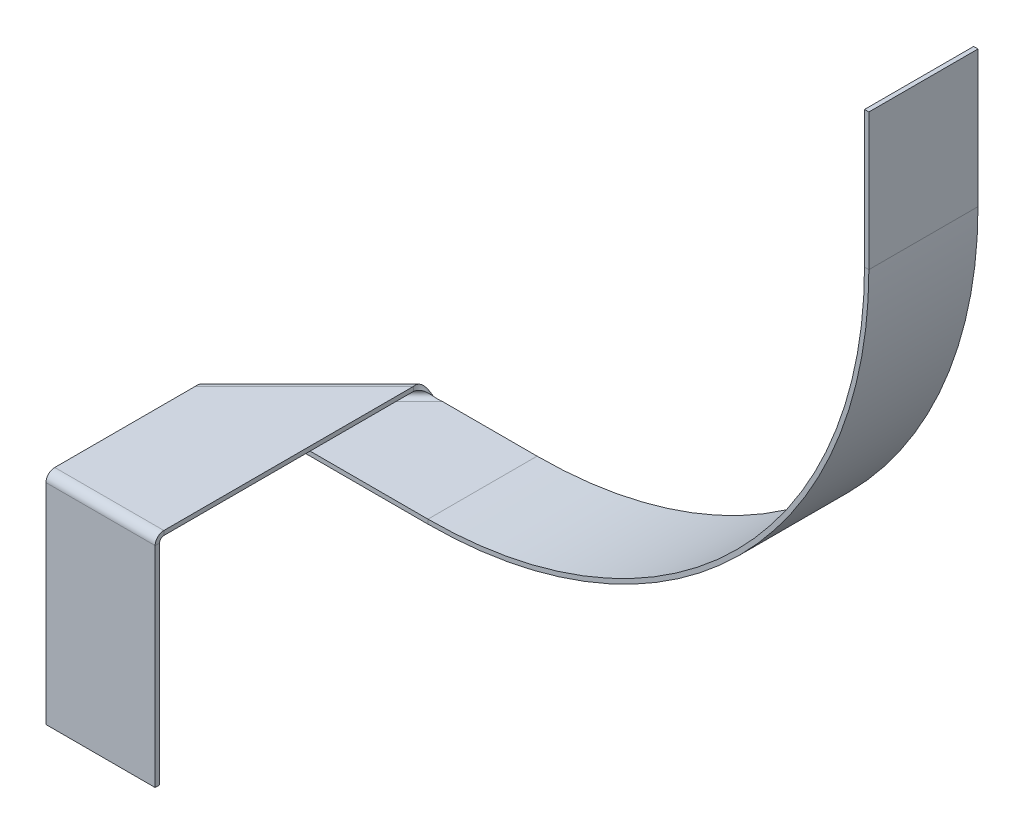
ISO-10303-21;
HEADER;
FILE_DESCRIPTION(('STEP AP214'),'2;1');
FILE_NAME('part.step','',(''),(''),'','','');
FILE_SCHEMA(('AUTOMOTIVE_DESIGN { 1 0 10303 214 1 1 1 1 }'));
ENDSEC;
DATA;
#1=APPLICATION_CONTEXT('core data for automotive mechanical design processes');
#2=APPLICATION_PROTOCOL_DEFINITION('international standard','automotive_design',2000,#1);
#3=PRODUCT_CONTEXT('',#1,'mechanical');
#4=PRODUCT('Part','Part','',(#3));
#5=PRODUCT_RELATED_PRODUCT_CATEGORY('part','',(#4));
#6=PRODUCT_DEFINITION_FORMATION('','',#4);
#7=PRODUCT_DEFINITION_CONTEXT('part definition',#1,'design');
#8=PRODUCT_DEFINITION('design','',#6,#7);
#9=PRODUCT_DEFINITION_SHAPE('','',#8);
#10=(LENGTH_UNIT() NAMED_UNIT(*) SI_UNIT(.MILLI.,.METRE.));
#11=(NAMED_UNIT(*) PLANE_ANGLE_UNIT() SI_UNIT($,.RADIAN.));
#12=(NAMED_UNIT(*) SI_UNIT($,.STERADIAN.) SOLID_ANGLE_UNIT());
#13=UNCERTAINTY_MEASURE_WITH_UNIT(LENGTH_MEASURE(1.E-05),#10,'distance_accuracy_value','');
#14=(GEOMETRIC_REPRESENTATION_CONTEXT(3) GLOBAL_UNCERTAINTY_ASSIGNED_CONTEXT((#13)) GLOBAL_UNIT_ASSIGNED_CONTEXT((#10,
#11,#12)) REPRESENTATION_CONTEXT('',''));
#15=CARTESIAN_POINT('',(0.,0.,0.));
#16=DIRECTION('',(0.,0.,1.));
#17=DIRECTION('',(1.,0.,0.));
#18=AXIS2_PLACEMENT_3D('',#15,#16,#17);
#19=CARTESIAN_POINT('',(453.287611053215,94.0000000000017,-124.999999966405));
#20=DIRECTION('',(0.,-1.,0.));
#21=DIRECTION('',(0.,0.,-1.));
#22=AXIS2_PLACEMENT_3D('',#19,#20,#21);
#23=PLANE('',#22);
#24=DIRECTION('',(-1.,0.,0.));
#25=VECTOR('',#24,1.);
#26=CARTESIAN_POINT('',(453.287611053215,94.0000000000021,-74.9999999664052));
#27=LINE('',#26,#25);
#28=CARTESIAN_POINT('',(75.,94.0000000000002,-74.9999999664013));
#29=VERTEX_POINT('',#28);
#30=CARTESIAN_POINT('',(-18.3356755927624,93.9999999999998,-74.9999999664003));
#31=VERTEX_POINT('',#30);
#32=EDGE_CURVE('E78',#29,#31,#27,.T.);
#33=ORIENTED_EDGE('',*,*,#32,.F.);
#34=DIRECTION('',(0.,0.,-1.));
#35=VECTOR('',#34,1.);
#36=CARTESIAN_POINT('',(75.,93.9999999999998,-124.999999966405));
#37=LINE('',#36,#35);
#38=CARTESIAN_POINT('',(75.,93.9999999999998,-124.999999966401));
#39=VERTEX_POINT('',#38);
#40=EDGE_CURVE('E70',#29,#39,#37,.T.);
#41=ORIENTED_EDGE('',*,*,#40,.T.);
#42=DIRECTION('',(-1.,0.,0.));
#43=VECTOR('',#42,1.);
#44=CARTESIAN_POINT('',(453.287611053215,94.0000000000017,-124.999999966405));
#45=LINE('',#44,#43);
#46=CARTESIAN_POINT('',(31.6643244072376,93.9999999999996,-124.999999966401));
#47=VERTEX_POINT('',#46);
#48=EDGE_CURVE('E86',#39,#47,#45,.T.);
#49=ORIENTED_EDGE('',*,*,#48,.T.);
#50=DIRECTION('',(0.707106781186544,0.,-0.707106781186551));
#51=VECTOR('',#50,1.);
#52=CARTESIAN_POINT('',(242.475967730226,93.9999999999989,-335.811643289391));
#53=LINE('',#52,#51);
#54=EDGE_CURVE('E222',#31,#47,#53,.T.);
#55=ORIENTED_EDGE('',*,*,#54,.F.);
#56=EDGE_LOOP('',(#33,#41,#49,#55));
#57=FACE_BOUND('',#56,.T.);
#58=ADVANCED_FACE('F60',(#57),#23,.F.);
#59=CARTESIAN_POINT('',(25.,97.9999999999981,-553.287611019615));
#60=DIRECTION('',(0.,1.,0.));
#61=DIRECTION('',(1.,0.,0.));
#62=AXIS2_PLACEMENT_3D('',#59,#60,#61);
#63=PLANE('',#62);
#64=DIRECTION('',(0.,0.,1.));
#65=VECTOR('',#64,1.);
#66=CARTESIAN_POINT('',(-25.,97.9999999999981,-553.287611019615));
#67=LINE('',#66,#65);
#68=CARTESIAN_POINT('',(-25.,97.9999999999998,-68.3356755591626));
#69=VERTEX_POINT('',#68);
#70=CARTESIAN_POINT('',(-25.,98.,-3.99999999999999));
#71=VERTEX_POINT('',#70);
#72=EDGE_CURVE('E391',#69,#71,#67,.T.);
#73=ORIENTED_EDGE('',*,*,#72,.F.);
#74=DIRECTION('',(0.707106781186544,0.,-0.707106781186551));
#75=VECTOR('',#74,1.);
#76=CARTESIAN_POINT('',(242.475967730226,97.9999999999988,-335.811643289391));
#77=LINE('',#76,#75);
#78=CARTESIAN_POINT('',(25.,97.9999999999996,-118.335675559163));
#79=VERTEX_POINT('',#78);
#80=EDGE_CURVE('E418',#69,#79,#77,.T.);
#81=ORIENTED_EDGE('',*,*,#80,.T.);
#82=DIRECTION('',(0.,0.,1.));
#83=VECTOR('',#82,1.);
#84=CARTESIAN_POINT('',(25.,97.9999999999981,-553.287611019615));
#85=LINE('',#84,#83);
#86=CARTESIAN_POINT('',(25.,98.,-3.99999999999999));
#87=VERTEX_POINT('',#86);
#88=EDGE_CURVE('E358',#79,#87,#85,.T.);
#89=ORIENTED_EDGE('',*,*,#88,.T.);
#90=DIRECTION('',(-1.,0.,0.));
#91=VECTOR('',#90,1.);
#92=CARTESIAN_POINT('',(25.,98.,-3.99999999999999));
#93=LINE('',#92,#91);
#94=EDGE_CURVE('E394',#87,#71,#93,.T.);
#95=ORIENTED_EDGE('',*,*,#94,.T.);
#96=EDGE_LOOP('',(#73,#81,#89,#95));
#97=FACE_BOUND('',#96,.T.);
#98=ADVANCED_FACE('F431',(#97),#63,.F.);
#99=CARTESIAN_POINT('',(-25.,99.9999999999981,-553.287611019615));
#100=DIRECTION('',(-1.,0.,0.));
#101=DIRECTION('',(0.,1.,0.));
#102=AXIS2_PLACEMENT_3D('',#99,#100,#101);
#103=PLANE('',#102);
#104=CARTESIAN_POINT('',(-25.,98.0000000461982,-68.3356755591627));
#105=CARTESIAN_POINT('',(-25.,100.000000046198,-68.3356755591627));
#106=B_SPLINE_CURVE_WITH_KNOTS('',1,(#104,#105),.UNSPECIFIED.,.F.,.F.,(2,2),(0.,1.),.UNSPECIFIED.);
#107=CARTESIAN_POINT('',(-25.,100.000000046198,-68.3356755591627));
#108=VERTEX_POINT('',#107);
#109=EDGE_CURVE('E413',#69,#108,#106,.T.);
#110=ORIENTED_EDGE('',*,*,#109,.F.);
#111=ORIENTED_EDGE('',*,*,#72,.T.);
#112=DIRECTION('',(0.,-1.,0.));
#113=VECTOR('',#112,1.);
#114=CARTESIAN_POINT('',(-25.,100.,-4.));
#115=LINE('',#114,#113);
#116=CARTESIAN_POINT('',(-25.,100.000000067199,-4.00000000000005));
#117=VERTEX_POINT('',#116);
#118=EDGE_CURVE('E390',#117,#71,#115,.T.);
#119=ORIENTED_EDGE('',*,*,#118,.F.);
#120=DIRECTION('',(0.,0.,1.));
#121=VECTOR('',#120,1.);
#122=CARTESIAN_POINT('',(-25.,99.9999999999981,-553.287611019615));
#123=LINE('',#122,#121);
#124=EDGE_CURVE('E401',#108,#117,#123,.T.);
#125=ORIENTED_EDGE('',*,*,#124,.F.);
#126=EDGE_LOOP('',(#110,#111,#119,#125));
#127=FACE_BOUND('',#126,.T.);
#128=ADVANCED_FACE('F420',(#127),#103,.T.);
#129=CARTESIAN_POINT('',(25.,99.9999999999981,-553.287611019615));
#130=DIRECTION('',(0.,1.,0.));
#131=DIRECTION('',(1.,0.,0.));
#132=AXIS2_PLACEMENT_3D('',#129,#130,#131);
#133=PLANE('',#132);
#134=DIRECTION('',(0.707106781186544,0.,-0.707106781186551));
#135=VECTOR('',#134,1.);
#136=CARTESIAN_POINT('',(242.475967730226,99.9999999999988,-335.811643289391));
#137=LINE('',#136,#135);
#138=CARTESIAN_POINT('',(25.,99.9999999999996,-118.335675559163));
#139=VERTEX_POINT('',#138);
#140=EDGE_CURVE('E400',#108,#139,#137,.T.);
#141=ORIENTED_EDGE('',*,*,#140,.F.);
#142=ORIENTED_EDGE('',*,*,#124,.T.);
#143=DIRECTION('',(-1.,0.,0.));
#144=VECTOR('',#143,1.);
#145=CARTESIAN_POINT('',(25.,100.,-4.));
#146=LINE('',#145,#144);
#147=CARTESIAN_POINT('',(25.,100.,-4.));
#148=VERTEX_POINT('',#147);
#149=EDGE_CURVE('E387',#148,#117,#146,.T.);
#150=ORIENTED_EDGE('',*,*,#149,.F.);
#151=DIRECTION('',(0.,0.,1.));
#152=VECTOR('',#151,1.);
#153=CARTESIAN_POINT('',(25.,99.9999999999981,-553.287611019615));
#154=LINE('',#153,#152);
#155=EDGE_CURVE('E403',#139,#148,#154,.T.);
#156=ORIENTED_EDGE('',*,*,#155,.F.);
#157=EDGE_LOOP('',(#141,#142,#150,#156));
#158=FACE_BOUND('',#157,.T.);
#159=ADVANCED_FACE('F430',(#158),#133,.T.);
#160=CARTESIAN_POINT('',(25.,97.9999999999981,-553.287611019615));
#161=DIRECTION('',(1.,0.,0.));
#162=DIRECTION('',(0.,-1.,0.));
#163=AXIS2_PLACEMENT_3D('',#160,#161,#162);
#164=PLANE('',#163);
#165=CARTESIAN_POINT('',(25.,100.000000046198,-118.335675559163));
#166=CARTESIAN_POINT('',(25.,98.000000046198,-118.335675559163));
#167=B_SPLINE_CURVE_WITH_KNOTS('',1,(#165,#166),.UNSPECIFIED.,.F.,.F.,(2,2),(0.,1.),.UNSPECIFIED.);
#168=EDGE_CURVE('E334',#139,#79,#167,.T.);
#169=ORIENTED_EDGE('',*,*,#168,.F.);
#170=ORIENTED_EDGE('',*,*,#155,.T.);
#171=DIRECTION('',(0.,1.,0.));
#172=VECTOR('',#171,1.);
#173=CARTESIAN_POINT('',(25.,98.,-3.99999999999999));
#174=LINE('',#173,#172);
#175=EDGE_CURVE('E397',#87,#148,#174,.T.);
#176=ORIENTED_EDGE('',*,*,#175,.F.);
#177=ORIENTED_EDGE('',*,*,#88,.F.);
#178=EDGE_LOOP('',(#169,#170,#176,#177));
#179=FACE_BOUND('',#178,.T.);
#180=ADVANCED_FACE('F560',(#179),#164,.T.);
#181=CARTESIAN_POINT('',(-25.,0.,-1.99999999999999));
#182=DIRECTION('',(0.,1.,0.));
#183=DIRECTION('',(0.,0.,1.));
#184=AXIS2_PLACEMENT_3D('',#181,#182,#183);
#185=PLANE('',#184);
#186=DIRECTION('',(1.,0.,0.));
#187=VECTOR('',#186,1.);
#188=CARTESIAN_POINT('',(25.,0.,-1.99999999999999));
#189=LINE('',#188,#187);
#190=CARTESIAN_POINT('',(25.,0.,-1.99999999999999));
#191=VERTEX_POINT('',#190);
#192=CARTESIAN_POINT('',(-25.,0.,-1.99999999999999));
#193=VERTEX_POINT('',#192);
#194=EDGE_CURVE('E362',#191,#193,#189,.F.);
#195=ORIENTED_EDGE('',*,*,#194,.F.);
#196=DIRECTION('',(0.,0.,1.));
#197=VECTOR('',#196,1.);
#198=CARTESIAN_POINT('',(25.,0.,-1.99999999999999));
#199=LINE('',#198,#197);
#200=CARTESIAN_POINT('',(25.,0.,0.));
#201=VERTEX_POINT('',#200);
#202=EDGE_CURVE('E383',#191,#201,#199,.T.);
#203=ORIENTED_EDGE('',*,*,#202,.T.);
#204=DIRECTION('',(-1.,0.,0.));
#205=VECTOR('',#204,1.);
#206=CARTESIAN_POINT('',(25.,0.,0.));
#207=LINE('',#206,#205);
#208=CARTESIAN_POINT('',(-25.,0.,0.));
#209=VERTEX_POINT('',#208);
#210=EDGE_CURVE('E380',#201,#209,#207,.T.);
#211=ORIENTED_EDGE('',*,*,#210,.T.);
#212=DIRECTION('',(0.,0.,-1.));
#213=VECTOR('',#212,1.);
#214=CARTESIAN_POINT('',(-25.,0.,0.));
#215=LINE('',#214,#213);
#216=EDGE_CURVE('E377',#209,#193,#215,.T.);
#217=ORIENTED_EDGE('',*,*,#216,.T.);
#218=EDGE_LOOP('',(#195,#203,#211,#217));
#219=FACE_BOUND('',#218,.T.);
#220=ADVANCED_FACE('F569',(#219),#185,.F.);
#221=CARTESIAN_POINT('',(25.,650.,0.));
#222=DIRECTION('',(0.,0.,1.));
#223=DIRECTION('',(1.,0.,0.));
#224=AXIS2_PLACEMENT_3D('',#221,#222,#223);
#225=PLANE('',#224);
#226=DIRECTION('',(0.,-1.,0.));
#227=VECTOR('',#226,1.);
#228=CARTESIAN_POINT('',(25.,650.,0.));
#229=LINE('',#228,#227);
#230=CARTESIAN_POINT('',(25.,96.,3.35996733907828E-08));
#231=VERTEX_POINT('',#230);
#232=EDGE_CURVE('E356',#231,#201,#229,.T.);
#233=ORIENTED_EDGE('',*,*,#232,.F.);
#234=DIRECTION('',(-1.,0.,0.));
#235=VECTOR('',#234,1.);
#236=CARTESIAN_POINT('',(25.,96.,0.));
#237=LINE('',#236,#235);
#238=CARTESIAN_POINT('',(-25.,96.,3.35996733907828E-08));
#239=VERTEX_POINT('',#238);
#240=EDGE_CURVE('E374',#231,#239,#237,.T.);
#241=ORIENTED_EDGE('',*,*,#240,.T.);
#242=DIRECTION('',(0.,-1.,0.));
#243=VECTOR('',#242,1.);
#244=CARTESIAN_POINT('',(-25.,650.,0.));
#245=LINE('',#244,#243);
#246=EDGE_CURVE('E372',#239,#209,#245,.T.);
#247=ORIENTED_EDGE('',*,*,#246,.T.);
#248=ORIENTED_EDGE('',*,*,#210,.F.);
#249=EDGE_LOOP('',(#233,#241,#247,#248));
#250=FACE_BOUND('',#249,.T.);
#251=ADVANCED_FACE('F586',(#250),#225,.T.);
#252=CARTESIAN_POINT('',(-25.,650.,0.));
#253=DIRECTION('',(-1.,0.,0.));
#254=DIRECTION('',(0.,0.,1.));
#255=AXIS2_PLACEMENT_3D('',#252,#253,#254);
#256=PLANE('',#255);
#257=ORIENTED_EDGE('',*,*,#246,.F.);
#258=DIRECTION('',(0.,0.,-1.));
#259=VECTOR('',#258,1.);
#260=CARTESIAN_POINT('',(-25.,96.,0.));
#261=LINE('',#260,#259);
#262=CARTESIAN_POINT('',(-25.,96.,-1.99999999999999));
#263=VERTEX_POINT('',#262);
#264=EDGE_CURVE('E369',#239,#263,#261,.T.);
#265=ORIENTED_EDGE('',*,*,#264,.T.);
#266=DIRECTION('',(0.,-1.,0.));
#267=VECTOR('',#266,1.);
#268=CARTESIAN_POINT('',(-25.,650.,-1.99999999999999));
#269=LINE('',#268,#267);
#270=EDGE_CURVE('E367',#263,#193,#269,.T.);
#271=ORIENTED_EDGE('',*,*,#270,.T.);
#272=ORIENTED_EDGE('',*,*,#216,.F.);
#273=EDGE_LOOP('',(#257,#265,#271,#272));
#274=FACE_BOUND('',#273,.T.);
#275=ADVANCED_FACE('F582',(#274),#256,.T.);
#276=CARTESIAN_POINT('',(25.,650.,-1.99999999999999));
#277=DIRECTION('',(0.,0.,1.));
#278=DIRECTION('',(1.,0.,0.));
#279=AXIS2_PLACEMENT_3D('',#276,#277,#278);
#280=PLANE('',#279);
#281=DIRECTION('',(-1.,0.,0.));
#282=VECTOR('',#281,1.);
#283=CARTESIAN_POINT('',(25.,96.,-1.99999999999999));
#284=LINE('',#283,#282);
#285=CARTESIAN_POINT('',(25.,96.,-1.99999993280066));
#286=VERTEX_POINT('',#285);
#287=EDGE_CURVE('E350',#286,#263,#284,.T.);
#288=ORIENTED_EDGE('',*,*,#287,.F.);
#289=DIRECTION('',(0.,-1.,0.));
#290=VECTOR('',#289,1.);
#291=CARTESIAN_POINT('',(25.,650.,-1.99999999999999));
#292=LINE('',#291,#290);
#293=EDGE_CURVE('E365',#286,#191,#292,.T.);
#294=ORIENTED_EDGE('',*,*,#293,.T.);
#295=ORIENTED_EDGE('',*,*,#194,.T.);
#296=ORIENTED_EDGE('',*,*,#270,.F.);
#297=EDGE_LOOP('',(#288,#294,#295,#296));
#298=FACE_BOUND('',#297,.T.);
#299=ADVANCED_FACE('F578',(#298),#280,.F.);
#300=CARTESIAN_POINT('',(25.,650.,-1.99999999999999));
#301=DIRECTION('',(1.,0.,0.));
#302=DIRECTION('',(0.,0.,-1.));
#303=AXIS2_PLACEMENT_3D('',#300,#301,#302);
#304=PLANE('',#303);
#305=ORIENTED_EDGE('',*,*,#293,.F.);
#306=DIRECTION('',(0.,0.,1.));
#307=VECTOR('',#306,1.);
#308=CARTESIAN_POINT('',(25.,96.,-1.99999999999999));
#309=LINE('',#308,#307);
#310=EDGE_CURVE('E359',#286,#231,#309,.T.);
#311=ORIENTED_EDGE('',*,*,#310,.T.);
#312=ORIENTED_EDGE('',*,*,#232,.T.);
#313=ORIENTED_EDGE('',*,*,#202,.F.);
#314=EDGE_LOOP('',(#305,#311,#312,#313));
#315=FACE_BOUND('',#314,.T.);
#316=ADVANCED_FACE('F574',(#315),#304,.T.);
#317=CARTESIAN_POINT('',(25.,96.,-4.00000006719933));
#318=DIRECTION('',(1.,0.,0.));
#319=DIRECTION('',(0.,0.,-1.));
#320=AXIS2_PLACEMENT_3D('',#317,#318,#319);
#321=PLANE('',#320);
#322=ORIENTED_EDGE('',*,*,#310,.F.);
#323=CARTESIAN_POINT('',(25.,96.,-3.99999999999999));
#324=DIRECTION('',(-1.,0.,0.));
#325=DIRECTION('',(0.,0.,1.));
#326=AXIS2_PLACEMENT_3D('',#323,#324,#325);
#327=CIRCLE('',#326,2.00000006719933);
#328=EDGE_CURVE('E353',#286,#87,#327,.T.);
#329=ORIENTED_EDGE('',*,*,#328,.T.);
#330=ORIENTED_EDGE('',*,*,#175,.T.);
#331=CARTESIAN_POINT('',(25.,96.,-4.00000006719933));
#332=DIRECTION('',(-1.,0.,0.));
#333=DIRECTION('',(0.,0.,-1.));
#334=AXIS2_PLACEMENT_3D('',#331,#332,#333);
#335=CIRCLE('',#334,4.000000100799);
#336=EDGE_CURVE('E338',#231,#148,#335,.T.);
#337=ORIENTED_EDGE('',*,*,#336,.F.);
#338=EDGE_LOOP('',(#322,#329,#330,#337));
#339=FACE_BOUND('',#338,.T.);
#340=ADVANCED_FACE('F577',(#339),#321,.T.);
#341=CARTESIAN_POINT('',(-25.,96.,-4.00000006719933));
#342=DIRECTION('',(-1.,0.,0.));
#343=DIRECTION('',(0.,0.,1.));
#344=AXIS2_PLACEMENT_3D('',#341,#342,#343);
#345=PLANE('',#344);
#346=ORIENTED_EDGE('',*,*,#118,.T.);
#347=CARTESIAN_POINT('',(-25.,96.,-3.99999999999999));
#348=DIRECTION('',(-1.,0.,0.));
#349=DIRECTION('',(0.,0.,1.));
#350=AXIS2_PLACEMENT_3D('',#347,#348,#349);
#351=CIRCLE('',#350,2.00000006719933);
#352=EDGE_CURVE('E347',#71,#263,#351,.F.);
#353=ORIENTED_EDGE('',*,*,#352,.T.);
#354=ORIENTED_EDGE('',*,*,#264,.F.);
#355=CARTESIAN_POINT('',(-25.,96.,-4.00000006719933));
#356=DIRECTION('',(1.,0.,0.));
#357=DIRECTION('',(0.,0.,-1.));
#358=AXIS2_PLACEMENT_3D('',#355,#356,#357);
#359=CIRCLE('',#358,4.000000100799);
#360=EDGE_CURVE('E346',#117,#239,#359,.T.);
#361=ORIENTED_EDGE('',*,*,#360,.F.);
#362=EDGE_LOOP('',(#346,#353,#354,#361));
#363=FACE_BOUND('',#362,.T.);
#364=ADVANCED_FACE('F596',(#363),#345,.T.);
#365=CARTESIAN_POINT('',(50.2613828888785,96.,-3.99999999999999));
#366=DIRECTION('',(-1.,0.,0.));
#367=DIRECTION('',(0.,0.,1.));
#368=AXIS2_PLACEMENT_3D('',#365,#366,#367);
#369=CYLINDRICAL_SURFACE('',#368,4.00000006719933);
#370=ORIENTED_EDGE('',*,*,#360,.T.);
#371=ORIENTED_EDGE('',*,*,#240,.F.);
#372=ORIENTED_EDGE('',*,*,#336,.T.);
#373=ORIENTED_EDGE('',*,*,#149,.T.);
#374=EDGE_LOOP('',(#370,#371,#372,#373));
#375=FACE_BOUND('',#374,.T.);
#376=ADVANCED_FACE('F308',(#375),#369,.T.);
#377=CARTESIAN_POINT('',(50.2613828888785,96.,-3.99999999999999));
#378=DIRECTION('',(-1.,0.,0.));
#379=DIRECTION('',(0.,0.,1.));
#380=AXIS2_PLACEMENT_3D('',#377,#378,#379);
#381=CYLINDRICAL_SURFACE('',#380,2.00000006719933);
#382=ORIENTED_EDGE('',*,*,#352,.F.);
#383=ORIENTED_EDGE('',*,*,#94,.F.);
#384=ORIENTED_EDGE('',*,*,#328,.F.);
#385=ORIENTED_EDGE('',*,*,#287,.T.);
#386=EDGE_LOOP('',(#382,#383,#384,#385));
#387=FACE_BOUND('',#386,.T.);
#388=ADVANCED_FACE('F600',(#387),#381,.F.);
#389=CARTESIAN_POINT('',(-18.3356755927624,91.9999999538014,-74.9999999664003));
#390=CARTESIAN_POINT('',(-18.983670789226,91.9999999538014,-75.0925707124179));
#391=CARTESIAN_POINT('',(-19.6313707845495,92.1041092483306,-75.1849744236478));
#392=CARTESIAN_POINT('',(-20.8708459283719,92.5048544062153,-75.3137288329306));
#393=CARTESIAN_POINT('',(-21.4622771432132,92.8013325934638,-75.3497996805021));
#394=CARTESIAN_POINT('',(-22.5412362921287,93.5418130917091,-75.318038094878));
#395=CARTESIAN_POINT('',(-23.0285582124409,93.9855240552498,-75.2499996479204));
#396=CARTESIAN_POINT('',(-23.8672881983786,94.9530084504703,-74.9780088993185));
#397=CARTESIAN_POINT('',(-24.2185847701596,95.4764012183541,-74.7739451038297));
#398=CARTESIAN_POINT('',(-24.7739451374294,96.5235987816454,-74.2185847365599));
#399=CARTESIAN_POINT('',(-24.9780089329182,97.0469915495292,-73.8672881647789));
#400=CARTESIAN_POINT('',(-25.2499996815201,98.0144759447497,-73.0285581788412));
#401=CARTESIAN_POINT('',(-25.3180381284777,98.4581869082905,-72.541236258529));
#402=CARTESIAN_POINT('',(-25.3497997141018,99.1986674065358,-71.4622771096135));
#403=CARTESIAN_POINT('',(-25.3137288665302,99.4951455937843,-70.8708458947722));
#404=CARTESIAN_POINT('',(-25.1849744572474,99.895890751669,-69.6313707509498));
#405=CARTESIAN_POINT('',(-25.0925707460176,100.000000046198,-68.9836707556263));
#406=CARTESIAN_POINT('',(-25.,100.000000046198,-68.3356755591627));
#407=CARTESIAN_POINT('',(-18.3356755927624,93.9999999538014,-74.9999999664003));
#408=CARTESIAN_POINT('',(-18.798501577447,93.9999999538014,-74.907434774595));
#409=CARTESIAN_POINT('',(-19.2612033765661,94.0520546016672,-74.8148070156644));
#410=CARTESIAN_POINT('',(-20.1586211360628,94.2524271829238,-74.6015040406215));
#411=CARTESIAN_POINT('',(-20.5931768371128,94.4006662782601,-74.4806993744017));
#412=CARTESIAN_POINT('',(-21.4103365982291,94.7709065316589,-74.1871384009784));
#413=CARTESIAN_POINT('',(-21.7928376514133,94.9927620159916,-74.0142790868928));
#414=CARTESIAN_POINT('',(-22.4898828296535,95.4765042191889,-73.6006035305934));
#415=CARTESIAN_POINT('',(-22.8043712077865,95.7382006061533,-73.3597315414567));
#416=CARTESIAN_POINT('',(-23.3597315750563,96.2617993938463,-72.8043711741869));
#417=CARTESIAN_POINT('',(-23.600603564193,96.5234957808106,-72.4898827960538));
#418=CARTESIAN_POINT('',(-24.0142791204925,97.0072379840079,-71.7928376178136));
#419=CARTESIAN_POINT('',(-24.1871384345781,97.2290934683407,-71.4103365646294));
#420=CARTESIAN_POINT('',(-24.4806994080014,97.5993337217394,-70.5931768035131));
#421=CARTESIAN_POINT('',(-24.6015040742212,97.7475728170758,-70.1586211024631));
#422=CARTESIAN_POINT('',(-24.8148070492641,97.9479453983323,-69.2612033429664));
#423=CARTESIAN_POINT('',(-24.9074348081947,98.0000000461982,-68.7985015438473));
#424=CARTESIAN_POINT('',(-25.,98.0000000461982,-68.3356755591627));
#425=B_SPLINE_SURFACE_WITH_KNOTS('',1,3,((#389,#390,#391,#392,#393,#394,#395,#396,#397,#398,
#399,#400,#401,#402,#403,#404,#405,#406),(#407,#408,#409,#410,#411,#412,#413,#414,#415,#416,
#417,#418,#419,#420,#421,#422,#423,#424)),.UNSPECIFIED.,.F.,.F.,.F.,(2,2),(4,2,2,2,2,2,2,2,4),
(0.,1.),(0.,0.125,0.25,0.375,0.5,0.625,0.75,0.875,1.),.UNSPECIFIED.);
#426=CARTESIAN_POINT('',(-18.3356755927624,91.9999999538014,-74.9999999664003));
#427=CARTESIAN_POINT('',(-18.3356755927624,93.9999999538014,-74.9999999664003));
#428=B_SPLINE_CURVE_WITH_KNOTS('',1,(#426,#427),.UNSPECIFIED.,.F.,.F.,(2,2),(0.,1.),.UNSPECIFIED.);
#429=CARTESIAN_POINT('',(-18.3356755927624,91.9999999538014,-74.9999999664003));
#430=VERTEX_POINT('',#429);
#431=EDGE_CURVE('E459',#31,#430,#428,.F.);
#432=CARTESIAN_POINT('',(-18.3356755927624,93.9999999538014,-74.9999999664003));
#433=CARTESIAN_POINT('',(-18.798501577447,93.9999999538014,-74.907434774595));
#434=CARTESIAN_POINT('',(-19.2612033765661,94.0520546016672,-74.8148070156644));
#435=CARTESIAN_POINT('',(-20.1586211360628,94.2524271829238,-74.6015040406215));
#436=CARTESIAN_POINT('',(-20.5931768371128,94.4006662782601,-74.4806993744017));
#437=CARTESIAN_POINT('',(-21.4103365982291,94.7709065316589,-74.1871384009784));
#438=CARTESIAN_POINT('',(-21.7928376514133,94.9927620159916,-74.0142790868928));
#439=CARTESIAN_POINT('',(-22.4898828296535,95.4765042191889,-73.6006035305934));
#440=CARTESIAN_POINT('',(-22.8043712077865,95.7382006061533,-73.3597315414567));
#441=CARTESIAN_POINT('',(-23.3597315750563,96.2617993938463,-72.8043711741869));
#442=CARTESIAN_POINT('',(-23.600603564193,96.5234957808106,-72.4898827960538));
#443=CARTESIAN_POINT('',(-24.0142791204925,97.0072379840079,-71.7928376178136));
#444=CARTESIAN_POINT('',(-24.1871384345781,97.2290934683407,-71.4103365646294));
#445=CARTESIAN_POINT('',(-24.4806994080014,97.5993337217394,-70.5931768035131));
#446=CARTESIAN_POINT('',(-24.6015040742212,97.7475728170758,-70.1586211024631));
#447=CARTESIAN_POINT('',(-24.8148070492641,97.9479453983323,-69.2612033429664));
#448=CARTESIAN_POINT('',(-24.9074348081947,98.0000000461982,-68.7985015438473));
#449=CARTESIAN_POINT('',(-25.,98.0000000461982,-68.3356755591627));
#450=B_SPLINE_CURVE_WITH_KNOTS('',3,(#432,#433,#434,#435,#436,#437,#438,#439,#440,#441,#442,
#443,#444,#445,#446,#447,#448,#449),.UNSPECIFIED.,.F.,.F.,(4,2,2,2,2,2,2,2,4),(0.,0.125,0.25,
0.375,0.5,0.625,0.75,0.875,1.),.UNSPECIFIED.);
#451=EDGE_CURVE('E524',#31,#69,#450,.T.);
#452=CARTESIAN_POINT('',(-25.,100.000000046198,-68.3356755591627));
#453=CARTESIAN_POINT('',(-25.0925707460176,100.000000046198,-68.9836707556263));
#454=CARTESIAN_POINT('',(-25.1849744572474,99.895890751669,-69.6313707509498));
#455=CARTESIAN_POINT('',(-25.3137288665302,99.4951455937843,-70.8708458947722));
#456=CARTESIAN_POINT('',(-25.3497997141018,99.1986674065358,-71.4622771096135));
#457=CARTESIAN_POINT('',(-25.3180381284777,98.4581869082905,-72.541236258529));
#458=CARTESIAN_POINT('',(-25.2499996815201,98.0144759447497,-73.0285581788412));
#459=CARTESIAN_POINT('',(-24.9780089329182,97.0469915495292,-73.8672881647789));
#460=CARTESIAN_POINT('',(-24.7739451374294,96.5235987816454,-74.2185847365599));
#461=CARTESIAN_POINT('',(-24.2185847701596,95.4764012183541,-74.7739451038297));
#462=CARTESIAN_POINT('',(-23.8672881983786,94.9530084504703,-74.9780088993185));
#463=CARTESIAN_POINT('',(-23.0285582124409,93.9855240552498,-75.2499996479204));
#464=CARTESIAN_POINT('',(-22.5412362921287,93.5418130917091,-75.318038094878));
#465=CARTESIAN_POINT('',(-21.4622771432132,92.8013325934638,-75.3497996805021));
#466=CARTESIAN_POINT('',(-20.8708459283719,92.5048544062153,-75.3137288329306));
#467=CARTESIAN_POINT('',(-19.6313707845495,92.1041092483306,-75.1849744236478));
#468=CARTESIAN_POINT('',(-18.983670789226,91.9999999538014,-75.0925707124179));
#469=CARTESIAN_POINT('',(-18.3356755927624,91.9999999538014,-74.9999999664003));
#470=B_SPLINE_CURVE_WITH_KNOTS('',3,(#452,#453,#454,#455,#456,#457,#458,#459,#460,#461,#462,
#463,#464,#465,#466,#467,#468,#469),.UNSPECIFIED.,.F.,.F.,(4,2,2,2,2,2,2,2,4),(0.,0.125,0.25,
0.375,0.5,0.625,0.75,0.875,1.),.UNSPECIFIED.);
#471=EDGE_CURVE('E525',#430,#108,#470,.F.);
#472=ORIENTED_EDGE('',*,*,#431,.F.);
#473=ORIENTED_EDGE('',*,*,#451,.T.);
#474=ORIENTED_EDGE('',*,*,#109,.T.);
#475=ORIENTED_EDGE('',*,*,#471,.F.);
#476=EDGE_LOOP('',(#472,#473,#474,#475));
#477=FACE_BOUND('',#476,.T.);
#478=ADVANCED_FACE('F246',(#477),#425,.T.);
#479=CARTESIAN_POINT('',(25.,100.000000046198,-118.335675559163));
#480=CARTESIAN_POINT('',(24.9074292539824,100.000000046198,-118.983670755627));
#481=CARTESIAN_POINT('',(24.8150255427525,99.8958907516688,-119.63137075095));
#482=CARTESIAN_POINT('',(24.6862711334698,99.4951455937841,-120.870845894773));
#483=CARTESIAN_POINT('',(24.6502002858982,99.1986674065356,-121.462277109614));
#484=CARTESIAN_POINT('',(24.6819618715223,98.4581869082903,-122.541236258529));
#485=CARTESIAN_POINT('',(24.7500003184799,98.0144759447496,-123.028558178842));
#486=CARTESIAN_POINT('',(25.0219910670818,97.046991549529,-123.867288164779));
#487=CARTESIAN_POINT('',(25.2260548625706,96.5235987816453,-124.21858473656));
#488=CARTESIAN_POINT('',(25.7814152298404,95.476401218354,-124.77394510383));
#489=CARTESIAN_POINT('',(26.1327118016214,94.9530084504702,-124.978008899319));
#490=CARTESIAN_POINT('',(26.9714417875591,93.9855240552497,-125.249999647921));
#491=CARTESIAN_POINT('',(27.4587637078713,93.5418130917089,-125.318038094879));
#492=CARTESIAN_POINT('',(28.5377228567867,92.8013325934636,-125.349799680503));
#493=CARTESIAN_POINT('',(29.1291540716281,92.5048544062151,-125.313728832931));
#494=CARTESIAN_POINT('',(30.3686292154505,92.1041092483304,-125.184974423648));
#495=CARTESIAN_POINT('',(31.016329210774,91.9999999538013,-125.092570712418));
#496=CARTESIAN_POINT('',(31.6643244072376,91.9999999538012,-124.999999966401));
#497=CARTESIAN_POINT('',(25.,98.000000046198,-118.335675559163));
#498=CARTESIAN_POINT('',(25.0925651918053,98.000000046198,-118.798501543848));
#499=CARTESIAN_POINT('',(25.1851929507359,97.9479453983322,-119.261203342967));
#500=CARTESIAN_POINT('',(25.3984959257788,97.7475728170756,-120.158621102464));
#501=CARTESIAN_POINT('',(25.5193005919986,97.5993337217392,-120.593176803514));
#502=CARTESIAN_POINT('',(25.8128615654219,97.2290934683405,-121.41033656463));
#503=CARTESIAN_POINT('',(25.9857208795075,97.0072379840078,-121.792837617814));
#504=CARTESIAN_POINT('',(26.3993964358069,96.5234957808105,-122.489882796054));
#505=CARTESIAN_POINT('',(26.6402684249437,96.2617993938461,-122.804371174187));
#506=CARTESIAN_POINT('',(27.1956287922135,95.7382006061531,-123.359731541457));
#507=CARTESIAN_POINT('',(27.5101171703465,95.4765042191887,-123.600603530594));
#508=CARTESIAN_POINT('',(28.2071623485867,94.9927620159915,-124.014279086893));
#509=CARTESIAN_POINT('',(28.5896634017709,94.7709065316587,-124.187138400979));
#510=CARTESIAN_POINT('',(29.4068231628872,94.40066627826,-124.480699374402));
#511=CARTESIAN_POINT('',(29.8413788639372,94.2524271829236,-124.601504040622));
#512=CARTESIAN_POINT('',(30.7387966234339,94.052054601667,-124.814807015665));
#513=CARTESIAN_POINT('',(31.201498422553,93.9999999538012,-124.907434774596));
#514=CARTESIAN_POINT('',(31.6643244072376,93.9999999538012,-124.999999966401));
#515=B_SPLINE_SURFACE_WITH_KNOTS('',1,3,((#479,#480,#481,#482,#483,#484,#485,#486,#487,#488,
#489,#490,#491,#492,#493,#494,#495,#496),(#497,#498,#499,#500,#501,#502,#503,#504,#505,#506,
#507,#508,#509,#510,#511,#512,#513,#514)),.UNSPECIFIED.,.F.,.F.,.F.,(2,2),(4,2,2,2,2,2,2,2,4),
(0.,1.),(0.,0.125,0.25,0.375,0.5,0.625,0.75,0.875,1.),.UNSPECIFIED.);
#516=CARTESIAN_POINT('',(25.,98.000000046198,-118.335675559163));
#517=CARTESIAN_POINT('',(25.0925651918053,98.000000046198,-118.798501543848));
#518=CARTESIAN_POINT('',(25.1851929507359,97.9479453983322,-119.261203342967));
#519=CARTESIAN_POINT('',(25.3984959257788,97.7475728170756,-120.158621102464));
#520=CARTESIAN_POINT('',(25.5193005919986,97.5993337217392,-120.593176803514));
#521=CARTESIAN_POINT('',(25.8128615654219,97.2290934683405,-121.41033656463));
#522=CARTESIAN_POINT('',(25.9857208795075,97.0072379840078,-121.792837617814));
#523=CARTESIAN_POINT('',(26.3993964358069,96.5234957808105,-122.489882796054));
#524=CARTESIAN_POINT('',(26.6402684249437,96.2617993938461,-122.804371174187));
#525=CARTESIAN_POINT('',(27.1956287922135,95.7382006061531,-123.359731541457));
#526=CARTESIAN_POINT('',(27.5101171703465,95.4765042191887,-123.600603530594));
#527=CARTESIAN_POINT('',(28.2071623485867,94.9927620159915,-124.014279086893));
#528=CARTESIAN_POINT('',(28.5896634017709,94.7709065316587,-124.187138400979));
#529=CARTESIAN_POINT('',(29.4068231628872,94.40066627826,-124.480699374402));
#530=CARTESIAN_POINT('',(29.8413788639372,94.2524271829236,-124.601504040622));
#531=CARTESIAN_POINT('',(30.7387966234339,94.052054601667,-124.814807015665));
#532=CARTESIAN_POINT('',(31.201498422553,93.9999999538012,-124.907434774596));
#533=CARTESIAN_POINT('',(31.6643244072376,93.9999999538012,-124.999999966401));
#534=B_SPLINE_CURVE_WITH_KNOTS('',3,(#516,#517,#518,#519,#520,#521,#522,#523,#524,#525,#526,
#527,#528,#529,#530,#531,#532,#533),.UNSPECIFIED.,.F.,.F.,(4,2,2,2,2,2,2,2,4),(0.,0.125,0.25,
0.375,0.5,0.625,0.75,0.875,1.),.UNSPECIFIED.);
#535=EDGE_CURVE('E277',#79,#47,#534,.T.);
#536=CARTESIAN_POINT('',(31.6643244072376,93.9999999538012,-124.999999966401));
#537=CARTESIAN_POINT('',(31.6643244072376,91.9999999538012,-124.999999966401));
#538=B_SPLINE_CURVE_WITH_KNOTS('',1,(#536,#537),.UNSPECIFIED.,.F.,.F.,(2,2),(0.,1.),.UNSPECIFIED.);
#539=CARTESIAN_POINT('',(31.6643244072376,91.9999999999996,-124.999999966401));
#540=VERTEX_POINT('',#539);
#541=EDGE_CURVE('E472',#540,#47,#538,.F.);
#542=CARTESIAN_POINT('',(31.6643244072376,91.9999999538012,-124.999999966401));
#543=CARTESIAN_POINT('',(31.016329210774,91.9999999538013,-125.092570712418));
#544=CARTESIAN_POINT('',(30.3686292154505,92.1041092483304,-125.184974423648));
#545=CARTESIAN_POINT('',(29.1291540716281,92.5048544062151,-125.313728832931));
#546=CARTESIAN_POINT('',(28.5377228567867,92.8013325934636,-125.349799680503));
#547=CARTESIAN_POINT('',(27.4587637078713,93.5418130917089,-125.318038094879));
#548=CARTESIAN_POINT('',(26.9714417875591,93.9855240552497,-125.249999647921));
#549=CARTESIAN_POINT('',(26.1327118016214,94.9530084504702,-124.978008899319));
#550=CARTESIAN_POINT('',(25.7814152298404,95.476401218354,-124.77394510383));
#551=CARTESIAN_POINT('',(25.2260548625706,96.5235987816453,-124.21858473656));
#552=CARTESIAN_POINT('',(25.0219910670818,97.046991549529,-123.867288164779));
#553=CARTESIAN_POINT('',(24.7500003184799,98.0144759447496,-123.028558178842));
#554=CARTESIAN_POINT('',(24.6819618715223,98.4581869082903,-122.541236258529));
#555=CARTESIAN_POINT('',(24.6502002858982,99.1986674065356,-121.462277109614));
#556=CARTESIAN_POINT('',(24.6862711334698,99.4951455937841,-120.870845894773));
#557=CARTESIAN_POINT('',(24.8150255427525,99.8958907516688,-119.63137075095));
#558=CARTESIAN_POINT('',(24.9074292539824,100.000000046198,-118.983670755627));
#559=CARTESIAN_POINT('',(25.,100.000000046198,-118.335675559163));
#560=B_SPLINE_CURVE_WITH_KNOTS('',3,(#542,#543,#544,#545,#546,#547,#548,#549,#550,#551,#552,
#553,#554,#555,#556,#557,#558,#559),.UNSPECIFIED.,.F.,.F.,(4,2,2,2,2,2,2,2,4),(0.,0.125,0.25,
0.375,0.5,0.625,0.75,0.875,1.),.UNSPECIFIED.);
#561=EDGE_CURVE('E270',#139,#540,#560,.F.);
#562=ORIENTED_EDGE('',*,*,#535,.T.);
#563=ORIENTED_EDGE('',*,*,#541,.F.);
#564=ORIENTED_EDGE('',*,*,#561,.F.);
#565=ORIENTED_EDGE('',*,*,#168,.T.);
#566=EDGE_LOOP('',(#562,#563,#564,#565));
#567=FACE_BOUND('',#566,.T.);
#568=ADVANCED_FACE('F244',(#567),#515,.T.);
#569=CARTESIAN_POINT('',(57.0724003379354,95.9999999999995,-150.408075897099));
#570=DIRECTION('',(-0.707106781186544,0.,0.707106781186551));
#571=DIRECTION('',(0.707106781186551,0.,0.707106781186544));
#572=AXIS2_PLACEMENT_3D('',#569,#570,#571);
#573=CYLINDRICAL_SURFACE('',#572,4.00000004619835);
#574=ORIENTED_EDGE('',*,*,#140,.T.);
#575=ORIENTED_EDGE('',*,*,#561,.T.);
#576=DIRECTION('',(0.707106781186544,0.,-0.707106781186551));
#577=VECTOR('',#576,1.);
#578=CARTESIAN_POINT('',(242.475967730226,91.9999999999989,-335.811643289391));
#579=LINE('',#578,#577);
#580=EDGE_CURVE('E469',#430,#540,#579,.T.);
#581=ORIENTED_EDGE('',*,*,#580,.F.);
#582=ORIENTED_EDGE('',*,*,#471,.T.);
#583=EDGE_LOOP('',(#574,#575,#581,#582));
#584=FACE_BOUND('',#583,.T.);
#585=ADVANCED_FACE('F233',(#584),#573,.T.);
#586=CARTESIAN_POINT('',(57.0724003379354,95.9999999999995,-150.408075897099));
#587=DIRECTION('',(-0.707106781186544,0.,0.707106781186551));
#588=DIRECTION('',(0.707106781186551,0.,0.707106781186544));
#589=AXIS2_PLACEMENT_3D('',#586,#587,#588);
#590=CYLINDRICAL_SURFACE('',#589,2.00000004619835);
#591=ORIENTED_EDGE('',*,*,#80,.F.);
#592=ORIENTED_EDGE('',*,*,#451,.F.);
#593=ORIENTED_EDGE('',*,*,#54,.T.);
#594=ORIENTED_EDGE('',*,*,#535,.F.);
#595=EDGE_LOOP('',(#591,#592,#593,#594));
#596=FACE_BOUND('',#595,.T.);
#597=ADVANCED_FACE('F243',(#596),#590,.F.);
#598=CARTESIAN_POINT('',(453.287611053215,92.0000000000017,-124.999999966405));
#599=DIRECTION('',(0.,-1.,0.));
#600=DIRECTION('',(0.,0.,-1.));
#601=AXIS2_PLACEMENT_3D('',#598,#599,#600);
#602=PLANE('',#601);
#603=DIRECTION('',(0.,0.,-1.));
#604=VECTOR('',#603,1.);
#605=CARTESIAN_POINT('',(75.,91.9999999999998,-124.999999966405));
#606=LINE('',#605,#604);
#607=CARTESIAN_POINT('',(75.,91.9999999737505,-74.9999999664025));
#608=VERTEX_POINT('',#607);
#609=CARTESIAN_POINT('',(75.,91.9999999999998,-124.999999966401));
#610=VERTEX_POINT('',#609);
#611=EDGE_CURVE('E481',#608,#610,#606,.T.);
#612=ORIENTED_EDGE('',*,*,#611,.F.);
#613=DIRECTION('',(-1.,0.,0.));
#614=VECTOR('',#613,1.);
#615=CARTESIAN_POINT('',(453.287611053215,92.0000000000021,-74.9999999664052));
#616=LINE('',#615,#614);
#617=EDGE_CURVE('E452',#608,#430,#616,.T.);
#618=ORIENTED_EDGE('',*,*,#617,.T.);
#619=ORIENTED_EDGE('',*,*,#580,.T.);
#620=DIRECTION('',(-1.,0.,0.));
#621=VECTOR('',#620,1.);
#622=CARTESIAN_POINT('',(453.287611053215,92.0000000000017,-124.999999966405));
#623=LINE('',#622,#621);
#624=EDGE_CURVE('E470',#610,#540,#623,.T.);
#625=ORIENTED_EDGE('',*,*,#624,.F.);
#626=EDGE_LOOP('',(#612,#618,#619,#625));
#627=FACE_BOUND('',#626,.T.);
#628=ADVANCED_FACE('F433',(#627),#602,.T.);
#629=CARTESIAN_POINT('',(453.287611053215,94.0000000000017,-124.999999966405));
#630=DIRECTION('',(0.,0.,-1.));
#631=DIRECTION('',(0.,1.,0.));
#632=AXIS2_PLACEMENT_3D('',#629,#630,#631);
#633=PLANE('',#632);
#634=DIRECTION('',(0.,1.,0.));
#635=VECTOR('',#634,1.);
#636=CARTESIAN_POINT('',(75.,93.9999999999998,-124.999999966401));
#637=LINE('',#636,#635);
#638=EDGE_CURVE('E484',#610,#39,#637,.T.);
#639=ORIENTED_EDGE('',*,*,#638,.F.);
#640=ORIENTED_EDGE('',*,*,#624,.T.);
#641=ORIENTED_EDGE('',*,*,#541,.T.);
#642=ORIENTED_EDGE('',*,*,#48,.F.);
#643=EDGE_LOOP('',(#639,#640,#641,#642));
#644=FACE_BOUND('',#643,.T.);
#645=ADVANCED_FACE('F436',(#644),#633,.T.);
#646=CARTESIAN_POINT('',(453.287611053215,92.0000000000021,-74.9999999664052));
#647=DIRECTION('',(0.,0.,1.));
#648=DIRECTION('',(0.,-1.,0.));
#649=AXIS2_PLACEMENT_3D('',#646,#647,#648);
#650=PLANE('',#649);
#651=DIRECTION('',(0.,-1.,0.));
#652=VECTOR('',#651,1.);
#653=CARTESIAN_POINT('',(75.,92.0000000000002,-74.9999999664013));
#654=LINE('',#653,#652);
#655=EDGE_CURVE('E12',#29,#608,#654,.T.);
#656=ORIENTED_EDGE('',*,*,#655,.F.);
#657=ORIENTED_EDGE('',*,*,#32,.T.);
#658=ORIENTED_EDGE('',*,*,#431,.T.);
#659=ORIENTED_EDGE('',*,*,#617,.F.);
#660=EDGE_LOOP('',(#656,#657,#658,#659));
#661=FACE_BOUND('',#660,.T.);
#662=ADVANCED_FACE('F62',(#661),#650,.T.);
#663=CARTESIAN_POINT('',(74.999999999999,294.0000000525,-74.9999999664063));
#664=DIRECTION('',(0.,0.,1.));
#665=DIRECTION('',(0.,-1.,0.));
#666=AXIS2_PLACEMENT_3D('',#663,#664,#665);
#667=PLANE('',#666);
#668=DIRECTION('',(1.,0.,0.));
#669=VECTOR('',#668,1.);
#670=CARTESIAN_POINT('',(276.999999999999,294.000000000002,-74.9999999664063));
#671=LINE('',#670,#669);
#672=CARTESIAN_POINT('',(274.999999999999,294.000000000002,-74.9999999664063));
#673=VERTEX_POINT('',#672);
#674=CARTESIAN_POINT('',(277.000000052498,294.000000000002,-74.9999999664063));
#675=VERTEX_POINT('',#674);
#676=EDGE_CURVE('E182',#673,#675,#671,.T.);
#677=ORIENTED_EDGE('',*,*,#676,.F.);
#678=CARTESIAN_POINT('',(74.999999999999,294.,-74.9999999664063));
#679=DIRECTION('',(0.,0.,1.));
#680=DIRECTION('',(0.,-1.,0.));
#681=AXIS2_PLACEMENT_3D('',#678,#679,#680);
#682=CIRCLE('',#681,200.0000000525);
#683=EDGE_CURVE('E197',#673,#29,#682,.F.);
#684=ORIENTED_EDGE('',*,*,#683,.T.);
#685=ORIENTED_EDGE('',*,*,#655,.T.);
#686=CARTESIAN_POINT('',(74.999999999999,294.0000000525,-74.9999999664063));
#687=DIRECTION('',(0.,0.,-1.));
#688=DIRECTION('',(0.,1.,0.));
#689=AXIS2_PLACEMENT_3D('',#686,#687,#688);
#690=CIRCLE('',#689,202.000000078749);
#691=EDGE_CURVE('E215',#675,#608,#690,.T.);
#692=ORIENTED_EDGE('',*,*,#691,.F.);
#693=EDGE_LOOP('',(#677,#684,#685,#692));
#694=FACE_BOUND('',#693,.T.);
#695=ADVANCED_FACE('F502',(#694),#667,.T.);
#696=CARTESIAN_POINT('',(74.999999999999,294.000000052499,-124.999999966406));
#697=DIRECTION('',(0.,0.,-1.));
#698=DIRECTION('',(0.,1.,0.));
#699=AXIS2_PLACEMENT_3D('',#696,#697,#698);
#700=PLANE('',#699);
#701=CARTESIAN_POINT('',(74.999999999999,294.,-124.999999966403));
#702=DIRECTION('',(0.,0.,1.));
#703=DIRECTION('',(0.,-1.,0.));
#704=AXIS2_PLACEMENT_3D('',#701,#702,#703);
#705=CIRCLE('',#704,200.0000000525);
#706=CARTESIAN_POINT('',(274.999999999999,294.000000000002,-124.999999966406));
#707=VERTEX_POINT('',#706);
#708=EDGE_CURVE('E219',#39,#707,#705,.T.);
#709=ORIENTED_EDGE('',*,*,#708,.T.);
#710=DIRECTION('',(-1.,0.,0.));
#711=VECTOR('',#710,1.);
#712=CARTESIAN_POINT('',(274.999999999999,294.000000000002,-124.999999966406));
#713=LINE('',#712,#711);
#714=CARTESIAN_POINT('',(276.999999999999,294.000000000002,-124.999999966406));
#715=VERTEX_POINT('',#714);
#716=EDGE_CURVE('E203',#715,#707,#713,.T.);
#717=ORIENTED_EDGE('',*,*,#716,.F.);
#718=CARTESIAN_POINT('',(74.999999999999,294.000000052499,-124.999999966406));
#719=DIRECTION('',(0.,0.,1.));
#720=DIRECTION('',(0.,1.,0.));
#721=AXIS2_PLACEMENT_3D('',#718,#719,#720);
#722=CIRCLE('',#721,202.000000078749);
#723=EDGE_CURVE('E218',#610,#715,#722,.T.);
#724=ORIENTED_EDGE('',*,*,#723,.F.);
#725=ORIENTED_EDGE('',*,*,#638,.T.);
#726=EDGE_LOOP('',(#709,#717,#724,#725));
#727=FACE_BOUND('',#726,.T.);
#728=ADVANCED_FACE('F247',(#727),#700,.T.);
#729=CARTESIAN_POINT('',(74.999999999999,293.999999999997,-419.670880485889));
#730=DIRECTION('',(0.,0.,1.));
#731=DIRECTION('',(0.,-1.,0.));
#732=AXIS2_PLACEMENT_3D('',#729,#730,#731);
#733=CYLINDRICAL_SURFACE('',#732,202.0000000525);
#734=ORIENTED_EDGE('',*,*,#611,.T.);
#735=ORIENTED_EDGE('',*,*,#723,.T.);
#736=DIRECTION('',(0.,0.,-1.));
#737=VECTOR('',#736,1.);
#738=CARTESIAN_POINT('',(276.999999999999,294.000000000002,-124.999999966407));
#739=LINE('',#738,#737);
#740=EDGE_CURVE('E186',#675,#715,#739,.T.);
#741=ORIENTED_EDGE('',*,*,#740,.F.);
#742=ORIENTED_EDGE('',*,*,#691,.T.);
#743=EDGE_LOOP('',(#734,#735,#741,#742));
#744=FACE_BOUND('',#743,.T.);
#745=ADVANCED_FACE('F516',(#744),#733,.T.);
#746=CARTESIAN_POINT('',(74.999999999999,293.999999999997,-419.670880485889));
#747=DIRECTION('',(0.,0.,1.));
#748=DIRECTION('',(0.,-1.,0.));
#749=AXIS2_PLACEMENT_3D('',#746,#747,#748);
#750=CYLINDRICAL_SURFACE('',#749,200.0000000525);
#751=ORIENTED_EDGE('',*,*,#40,.F.);
#752=ORIENTED_EDGE('',*,*,#683,.F.);
#753=DIRECTION('',(0.,0.,-1.));
#754=VECTOR('',#753,1.);
#755=CARTESIAN_POINT('',(274.999999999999,294.000000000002,-124.999999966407));
#756=LINE('',#755,#754);
#757=EDGE_CURVE('E212',#673,#707,#756,.T.);
#758=ORIENTED_EDGE('',*,*,#757,.T.);
#759=ORIENTED_EDGE('',*,*,#708,.F.);
#760=EDGE_LOOP('',(#751,#752,#758,#759));
#761=FACE_BOUND('',#760,.T.);
#762=ADVANCED_FACE('F493',(#761),#750,.F.);
#763=CARTESIAN_POINT('',(274.999999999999,356.557549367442,-74.9999999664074));
#764=DIRECTION('',(0.,1.,0.));
#765=DIRECTION('',(1.,0.,0.));
#766=AXIS2_PLACEMENT_3D('',#763,#764,#765);
#767=PLANE('',#766);
#768=DIRECTION('',(0.,0.,-1.));
#769=VECTOR('',#768,1.);
#770=CARTESIAN_POINT('',(274.999999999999,356.557549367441,-124.999999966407));
#771=LINE('',#770,#769);
#772=CARTESIAN_POINT('',(274.999999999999,356.557549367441,-124.999999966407));
#773=VERTEX_POINT('',#772);
#774=CARTESIAN_POINT('',(274.999999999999,356.557549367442,-74.9999999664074));
#775=VERTEX_POINT('',#774);
#776=EDGE_CURVE('E187',#773,#775,#771,.F.);
#777=ORIENTED_EDGE('',*,*,#776,.T.);
#778=DIRECTION('',(-1.,0.,0.));
#779=VECTOR('',#778,1.);
#780=CARTESIAN_POINT('',(276.999999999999,356.557549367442,-74.9999999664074));
#781=LINE('',#780,#779);
#782=CARTESIAN_POINT('',(276.999999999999,356.557549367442,-74.9999999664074));
#783=VERTEX_POINT('',#782);
#784=EDGE_CURVE('E180',#783,#775,#781,.T.);
#785=ORIENTED_EDGE('',*,*,#784,.F.);
#786=DIRECTION('',(0.,0.,1.));
#787=VECTOR('',#786,1.);
#788=CARTESIAN_POINT('',(276.999999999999,356.557549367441,-124.999999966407));
#789=LINE('',#788,#787);
#790=CARTESIAN_POINT('',(276.999999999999,356.557549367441,-124.999999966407));
#791=VERTEX_POINT('',#790);
#792=EDGE_CURVE('E193',#791,#783,#789,.T.);
#793=ORIENTED_EDGE('',*,*,#792,.F.);
#794=DIRECTION('',(1.,0.,0.));
#795=VECTOR('',#794,1.);
#796=CARTESIAN_POINT('',(274.999999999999,356.557549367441,-124.999999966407));
#797=LINE('',#796,#795);
#798=EDGE_CURVE('E509',#773,#791,#797,.T.);
#799=ORIENTED_EDGE('',*,*,#798,.F.);
#800=EDGE_LOOP('',(#777,#785,#793,#799));
#801=FACE_BOUND('',#800,.T.);
#802=ADVANCED_FACE('F191',(#801),#767,.T.);
#803=CARTESIAN_POINT('',(276.999999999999,356.557549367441,-124.999999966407));
#804=DIRECTION('',(1.,0.,0.));
#805=DIRECTION('',(0.,0.,-1.));
#806=AXIS2_PLACEMENT_3D('',#803,#804,#805);
#807=PLANE('',#806);
#808=DIRECTION('',(0.,-1.,0.));
#809=VECTOR('',#808,1.);
#810=CARTESIAN_POINT('',(276.999999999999,356.557549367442,-74.9999999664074));
#811=LINE('',#810,#809);
#812=EDGE_CURVE('E177',#783,#675,#811,.T.);
#813=ORIENTED_EDGE('',*,*,#812,.T.);
#814=ORIENTED_EDGE('',*,*,#740,.T.);
#815=DIRECTION('',(0.,-1.,0.));
#816=VECTOR('',#815,1.);
#817=CARTESIAN_POINT('',(276.999999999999,356.557549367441,-124.999999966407));
#818=LINE('',#817,#816);
#819=EDGE_CURVE('E201',#791,#715,#818,.T.);
#820=ORIENTED_EDGE('',*,*,#819,.F.);
#821=ORIENTED_EDGE('',*,*,#792,.T.);
#822=EDGE_LOOP('',(#813,#814,#820,#821));
#823=FACE_BOUND('',#822,.T.);
#824=ADVANCED_FACE('F199',(#823),#807,.T.);
#825=CARTESIAN_POINT('',(274.999999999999,356.557549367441,-124.999999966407));
#826=DIRECTION('',(0.,0.,-1.));
#827=DIRECTION('',(-1.,0.,0.));
#828=AXIS2_PLACEMENT_3D('',#825,#826,#827);
#829=PLANE('',#828);
#830=ORIENTED_EDGE('',*,*,#819,.T.);
#831=ORIENTED_EDGE('',*,*,#716,.T.);
#832=DIRECTION('',(0.,-1.,0.));
#833=VECTOR('',#832,1.);
#834=CARTESIAN_POINT('',(274.999999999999,356.557549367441,-124.999999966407));
#835=LINE('',#834,#833);
#836=EDGE_CURVE('E498',#773,#707,#835,.T.);
#837=ORIENTED_EDGE('',*,*,#836,.F.);
#838=ORIENTED_EDGE('',*,*,#798,.T.);
#839=EDGE_LOOP('',(#830,#831,#837,#838));
#840=FACE_BOUND('',#839,.T.);
#841=ADVANCED_FACE('F514',(#840),#829,.T.);
#842=CARTESIAN_POINT('',(274.999999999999,356.557549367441,-124.999999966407));
#843=DIRECTION('',(1.,0.,0.));
#844=DIRECTION('',(0.,0.,-1.));
#845=AXIS2_PLACEMENT_3D('',#842,#843,#844);
#846=PLANE('',#845);
#847=ORIENTED_EDGE('',*,*,#757,.F.);
#848=DIRECTION('',(0.,-1.,0.));
#849=VECTOR('',#848,1.);
#850=CARTESIAN_POINT('',(274.999999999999,356.557549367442,-74.9999999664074));
#851=LINE('',#850,#849);
#852=EDGE_CURVE('E497',#775,#673,#851,.T.);
#853=ORIENTED_EDGE('',*,*,#852,.F.);
#854=ORIENTED_EDGE('',*,*,#776,.F.);
#855=ORIENTED_EDGE('',*,*,#836,.T.);
#856=EDGE_LOOP('',(#847,#853,#854,#855));
#857=FACE_BOUND('',#856,.T.);
#858=ADVANCED_FACE('F496',(#857),#846,.F.);
#859=CARTESIAN_POINT('',(276.999999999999,356.557549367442,-74.9999999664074));
#860=DIRECTION('',(0.,0.,1.));
#861=DIRECTION('',(1.,0.,0.));
#862=AXIS2_PLACEMENT_3D('',#859,#860,#861);
#863=PLANE('',#862);
#864=ORIENTED_EDGE('',*,*,#852,.T.);
#865=ORIENTED_EDGE('',*,*,#676,.T.);
#866=ORIENTED_EDGE('',*,*,#812,.F.);
#867=ORIENTED_EDGE('',*,*,#784,.T.);
#868=EDGE_LOOP('',(#864,#865,#866,#867));
#869=FACE_BOUND('',#868,.T.);
#870=ADVANCED_FACE('F179',(#869),#863,.T.);
#871=CLOSED_SHELL('',(#58,#98,#128,#159,#180,#220,#251,#275,#299,#316,#340,#364,#376,#388,#478,
#568,#585,#597,#628,#645,#662,#695,#728,#745,#762,#802,#824,#841,#858,#870));
#872=MANIFOLD_SOLID_BREP('B2',#871);
#873=ADVANCED_BREP_SHAPE_REPRESENTATION('',(#18,#872),#14);
#874=SHAPE_DEFINITION_REPRESENTATION(#9,#873);
ENDSEC;
END-ISO-10303-21;
